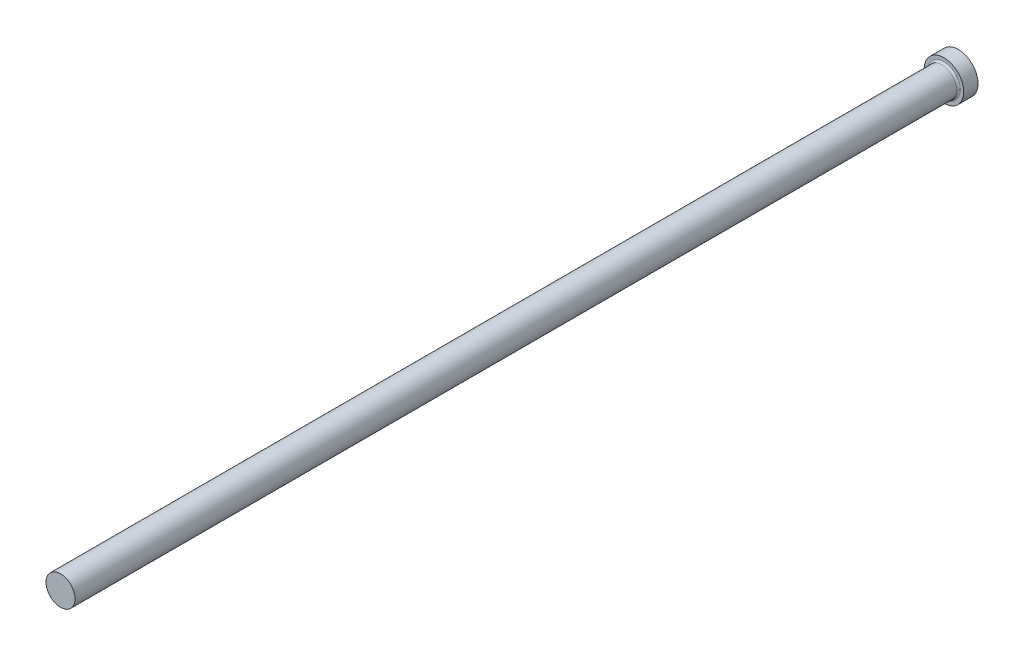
from build123d import *

# Parameters (mm, degrees)
FILLET1_R = 0.5


with BuildPart() as part:
    # FV → Revolve1 (revolve)
    with BuildSketch(Plane(origin=(0, 0, 0), x_dir=(1, 0, 0), z_dir=(0, 1, 0)), mode=Mode.PRIVATE) as revolve1_sk:
        Polygon((0, 0), (5.5, 0), (5.5, -4), (4.05, -4), (4.05, -250), (0, -250), align=None)
    revolve(revolve1_sk.sketch.rotate(Axis((0, 0, -9.033228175), (0, 0, 1)), 180), axis=Axis((0, 0, -9.033228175), (0, 0, 1)))

    # Fillet1
    fillet1_edges = [part.edges().sort_by_distance(p)[0] for p in [
        (4.05, 0, 4),
    ]]
    fillet(fillet1_edges, radius=FILLET1_R)


solid = part.part
